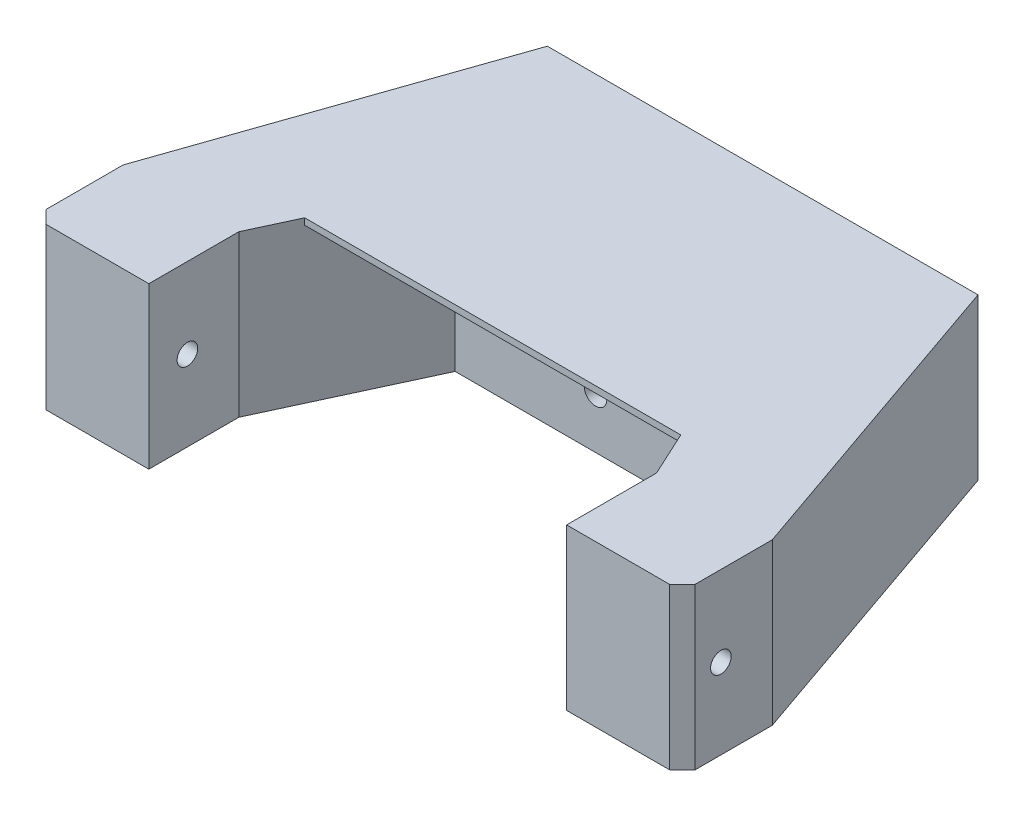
from build123d import *

# Parameters (mm, degrees)
SKETCH_1_R          = 8.05
EXTRUDE_1_DEPTH     = 25
EXTRUDE_START       = -1
SKETCH_10_R         = 8.05
EXTRUDE_3_DEPTH     = 1
EXTRUDE_4_DEPTH     = 1
SKETCH_12_W         = 18
SKETCH_12_H         = 25
EXTRUDE_5_DEPTH     = 14
SKETCH_15_R         = 1.6
CUT_EXTRUDE_6_DEPTH = 231
EXTRUDE_6_DEPTH     = 24
SKETCH_8_R          = 1.75
CUT_EXTRUDE_2_DEPTH = 27
SKETCH_9_R          = 3.5
CUT_EXTRUDE_3_DEPTH = 12
CUT_EXTRUDE_7_DEPTH = 85


with BuildPart() as part:
    # Sketch 1 → Extrude 1 (new body)
    with BuildSketch(Plane(origin=(0, 0, 0), x_dir=(1, 0, 0), z_dir=(0, 1, 0))):
        Polygon((-33.5, 22), (33.5, 22), (50.5, -27), (32.5, -27), (20, 0), (0, 0), (-20, 0), (-32.5, -27), (-50.5, -27), align=None)
        with Locations(Location((25, 10, 0), (0, 0, 270))):
            Circle(SKETCH_1_R, mode=Mode.SUBTRACT)
        with Locations(Location((-25, 10, 0), (0, 0, 270))):
            Circle(SKETCH_1_R, mode=Mode.SUBTRACT)
    extrude(amount=EXTRUDE_1_DEPTH)

    # Sketch 10 → Extrude 3 (add)
    with BuildSketch(Plane(origin=(0, 25, 0), x_dir=(1, 0, 0), z_dir=(0, 1, 0)).offset(EXTRUDE_START)):
        with Locations(Location((-25, 10, 0), (0, 0, 270))):
            Circle(SKETCH_10_R)
        with Locations(Location((25, 10, 0), (0, 0, 270))):
            Circle(SKETCH_10_R)
    extrude(amount=EXTRUDE_3_DEPTH)

    # Sketch 11 → Extrude 4 (add)
    with BuildSketch(Plane(origin=(0, 25, 0), x_dir=(1, 0, 0), z_dir=(0, 1, 0))):
        Polygon((-20, 0), (-29.259259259, -20), (29.259259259, -20), (20, 0), align=None)
    extrude(amount=-EXTRUDE_4_DEPTH)

    # Sketch 12 → Extrude 5 (add)
    with BuildSketch(Plane.XY.offset(27)):
        with Locations((-41.5, 12.5)):
            Rectangle(SKETCH_12_W, SKETCH_12_H)
        with Locations((41.5, 12.5)):
            Rectangle(SKETCH_12_W, SKETCH_12_H)
    extrude(amount=EXTRUDE_5_DEPTH)

    # Sketch 15 → Cut-Extrude 6 (cut)
    with BuildSketch(Plane.ZY.offset(50.5)):
        with Locations((35, 12.5)):
            Circle(SKETCH_15_R)
    extrude(amount=-CUT_EXTRUDE_6_DEPTH, mode=Mode.SUBTRACT)

    # Sketch 16 → Extrude 6 (add)
    with BuildSketch(Plane.XZ):
        Polygon((-21.851851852, 4), (-20, 0), (20, 0), (21.851851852, 4), align=None)
    extrude(amount=-EXTRUDE_6_DEPTH)

    # Sketch 8 → Cut-Extrude 2 (cut)
    with BuildSketch(Plane(origin=(0, 0, -22), x_dir=(-1, 0, 0), z_dir=(0, 0, -1))):
        with Locations((0, 8)):
            Circle(SKETCH_8_R)
    extrude(amount=-CUT_EXTRUDE_2_DEPTH, mode=Mode.SUBTRACT)

    # Sketch 9 → Cut-Extrude 3 (cut)
    with BuildSketch(Plane(origin=(0, 0, -22), x_dir=(-1, 0, 0), z_dir=(0, 0, -1))):
        with Locations((0, 8)):
            Circle(SKETCH_9_R)
    extrude(amount=-CUT_EXTRUDE_3_DEPTH, mode=Mode.SUBTRACT)

    # Sketch 17 → Cut-Extrude 7 (cut)
    with BuildSketch(Plane(origin=(0, 25, 0), x_dir=(1, 0, 0), z_dir=(0, 1, 0))):
        Polygon((-50.5, -39), (-48.5, -41), (-50.5, -41), align=None)
        Polygon((50.5, -39), (50.5, -41), (48.5, -41), align=None)
    extrude(amount=-CUT_EXTRUDE_7_DEPTH, mode=Mode.SUBTRACT)


solid = part.part
